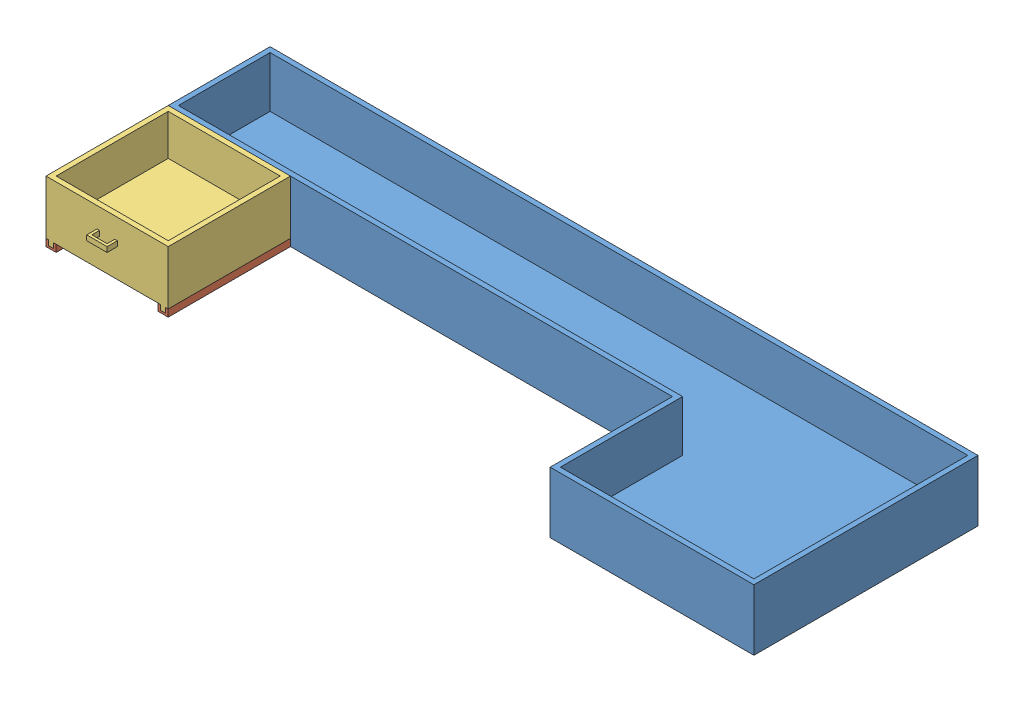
SolidWorks assembly Full storage Assembly.SLDASM, configuration Default (file format 12000). Lengths in mm.
Overall size (1765.3 152.4 584.2).
4 component instances, 3 part files, 9 mates.
Components (placement in the parent):
- Storage Design-1: Storage Design.SLDPRT [Default] at origin size (1765.3 152.4 558.8)
- Bracket-2: Bracket.SLDPRT [Default] at (0 -76.2 152.4) size (25.4 17.78 304.8)
- Bracket-3: Bracket.SLDPRT [Default] at (279.4 -76.2 152.4) size (25.4 17.78 304.8)
- Drawer-1: Drawer.SLDPRT [Default] at (152.4 -58.42 152.4) size (304.8 147.32 330.2)
Mates (geometry in assembly coordinates):
- Coincident4: coincident aligned: plane of Storage Design-1 through (0 -76.2 0) normal (0 -1 0); plane of Bracket-2 through (25.4 -76.2 304.8) normal (0 -1 0)
- Coincident5: coincident anti-aligned: plane of Storage Design-1 through (1257.3 76.2 0) normal (0 0 1); plane of Bracket-2 through (0 -76.2 0) normal (0 0 -1)
- Coincident6: coincident aligned: plane of Storage Design-1 through (0 76.2 0) normal (-1 0 0); plane of Bracket-2 through (0 -76.2 304.8) normal (-1 0 0)
- Coincident7: coincident anti-aligned: plane of Bracket-2 through (6.35 -71.12 304.8) normal (0 1 0); plane of Drawer-1 through (6.35 -71.12 304.8) normal (0 -1 0)
- Coincident9: coincident anti-aligned: plane of Bracket-2 through (19.05 -71.12 304.8) normal (-1 0 0); plane of Drawer-1 through (19.05 -71.12 304.8) normal (1 0 0)
- Coincident10: coincident anti-aligned: plane of Storage Design-1 through (1257.3 76.2 0) normal (0 0 1); plane of Bracket-3 through (279.4 -76.2 0) normal (0 0 -1)
- Coincident11: coincident aligned: plane of Bracket-3 through (304.8 -58.42 304.8) normal (1 0 0); plane of Drawer-1 through (304.8 76.2 304.8) normal (1 0 0)
- Coincident12: coincident aligned: plane of Storage Design-1 through (0 -76.2 0) normal (0 -1 0); plane of Bracket-3 through (304.8 -76.2 304.8) normal (0 -1 0)
- Coincident13: coincident anti-aligned: plane of Storage Design-1 through (1257.3 76.2 0) normal (0 0 1); plane of Drawer-1 through (152.4 -58.42 0) normal (0 0 -1)
